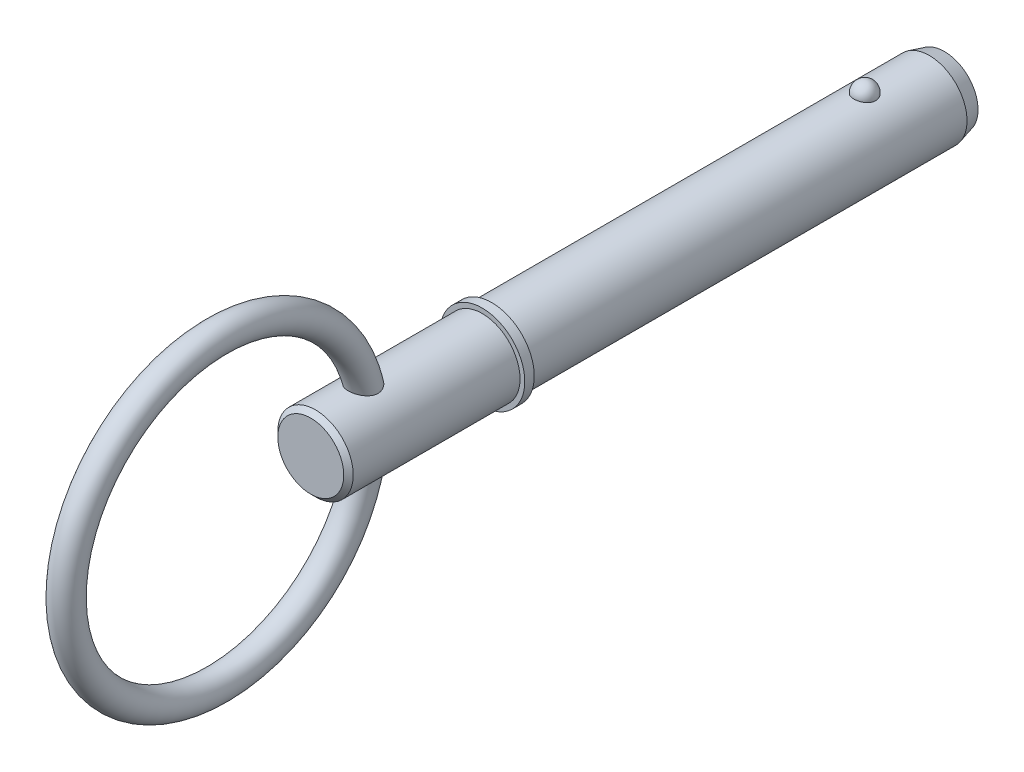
from build123d import *

# Parameters (mm, degrees)
SKETCH2_R           = 3.97
BOSS_EXTRUDE1_DEPTH = 38.1
BOSS_EXTRUDE2_START = 9.53
SKETCH3_R           = 3.97
BOSS_EXTRUDE2_DEPTH = 9.53
CHAMFER1_SIZE       = 1.586
CHAMFER1_SIZE2      = 0.424967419
SKETCH20_W          = 1
SKETCH20_H          = 4.47
SKETCH21_R          = 3.97
BOSS_EXTRUDE3_DEPTH = 19.05
CHAMFER2_SIZE       = 0.5
SKETCH24_R          = 1.5


with BuildPart() as part:
    # Sketch2 → Boss-Extrude1 (new body)
    with BuildSketch(Plane.XY):
        with Locations(Location((0, 0, 0), (0, 0, 180))):
            Circle(SKETCH2_R)
    extrude(amount=BOSS_EXTRUDE1_DEPTH)

    # Sketch3 → Boss-Extrude2 (add)
    with BuildSketch(Plane(origin=(0, 0, 0), x_dir=(-1, 0, 0), z_dir=(0, 0, -1)).offset(BOSS_EXTRUDE2_START)):
        Circle(SKETCH3_R)
    extrude(amount=-BOSS_EXTRUDE2_DEPTH)

    # Chamfer1
    chamfer1_edges = [part.edges().sort_by_distance(p)[0] for p in [
        (3.97, 0, -9.53),
    ]]
    chamfer1_side = [part.faces().sort_by_distance(p)[0] for p in [
        (3.97, 0, 14.285),
    ]]
    chamfer(chamfer1_edges, length=CHAMFER1_SIZE, length2=CHAMFER1_SIZE2, reference=chamfer1_side[0])

    # Sketch18 → Revolve1 (revolve)
    with BuildSketch(Plane(origin=(0, 0, 0), x_dir=(0, 0, -1), z_dir=(1, 0, 0))):
        with BuildLine():
            Line((1.15, 5.12), (1.15, 2.82))
            ThreePointArc((1.15, 2.82), (0, 3.97), (1.15, 5.12))
        make_face()
    revolve(axis=Axis((0, 5.12, -1.15), (0, -1, 0)))

    # Sketch20 → Revolve2 (revolve)
    with BuildSketch(Plane(origin=(0, 0, 0), x_dir=(0, 0, -1), z_dir=(1, 0, 0)), mode=Mode.PRIVATE) as revolve2_sk:
        with Locations((-38.6, 2.235)):
            Rectangle(SKETCH20_W, SKETCH20_H)
    revolve(revolve2_sk.sketch.rotate(Axis((0, 0, 33.728787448), (0, 0, 1)), 90), axis=Axis((0, 0, 33.728787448), (0, 0, 1)))

    # Sketch21 → Boss-Extrude3 (add)
    with BuildSketch(Plane(origin=(0, 0, 38.1), x_dir=(-1, 0, 0), z_dir=(0, 0, -1))):
        Circle(SKETCH21_R)
    extrude(amount=-BOSS_EXTRUDE3_DEPTH)

    # Chamfer2
    chamfer2_edges = [part.edges().sort_by_distance(p)[0] for p in [
        (3.97, 0, 57.15),
    ]]
    chamfer(chamfer2_edges, length=CHAMFER2_SIZE)

    # Sweep1: sweep along a path in Sketch23
    with BuildLine(Plane(origin=(0, 0, 0), x_dir=(0, 0, -1), z_dir=(1, 0, 0))) as sweep1_path:
        CenterArc((-67.025, 0), 15.875, 0, 360)
    # Sketch24 → Sweep1 (sweep)
    with BuildSketch(Plane(origin=(0, 0, 0), x_dir=(1, 0, 0), z_dir=(0, 1, 0))):
        with Locations((0, -51.15)):
            Circle(SKETCH24_R)
    sweep(path=sweep1_path.line)


solid = part.part
